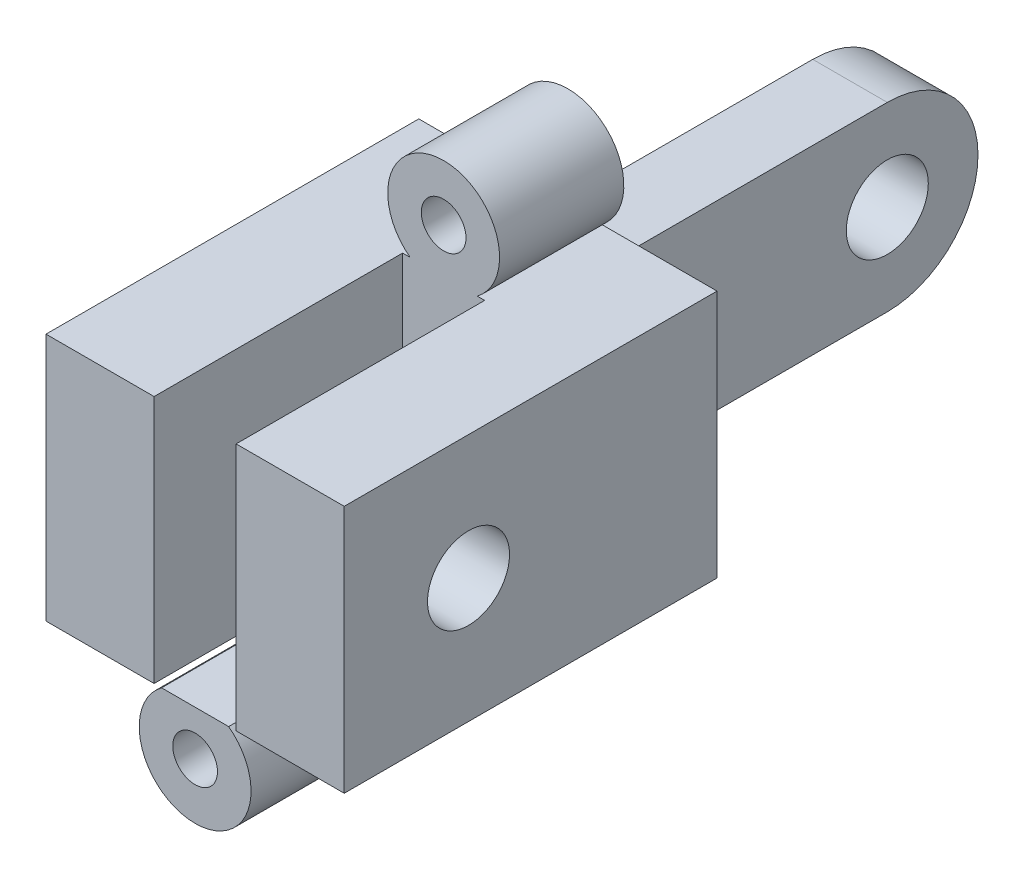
ISO-10303-21;
HEADER;
FILE_DESCRIPTION(('STEP AP214'),'2;1');
FILE_NAME('part.step','',(''),(''),'','','');
FILE_SCHEMA(('AUTOMOTIVE_DESIGN { 1 0 10303 214 1 1 1 1 }'));
ENDSEC;
DATA;
#1=APPLICATION_CONTEXT('core data for automotive mechanical design processes');
#2=APPLICATION_PROTOCOL_DEFINITION('international standard','automotive_design',2000,#1);
#3=PRODUCT_CONTEXT('',#1,'mechanical');
#4=PRODUCT('Part','Part','',(#3));
#5=PRODUCT_RELATED_PRODUCT_CATEGORY('part','',(#4));
#6=PRODUCT_DEFINITION_FORMATION('','',#4);
#7=PRODUCT_DEFINITION_CONTEXT('part definition',#1,'design');
#8=PRODUCT_DEFINITION('design','',#6,#7);
#9=PRODUCT_DEFINITION_SHAPE('','',#8);
#10=(LENGTH_UNIT() NAMED_UNIT(*) SI_UNIT(.MILLI.,.METRE.));
#11=(NAMED_UNIT(*) PLANE_ANGLE_UNIT() SI_UNIT($,.RADIAN.));
#12=(NAMED_UNIT(*) SI_UNIT($,.STERADIAN.) SOLID_ANGLE_UNIT());
#13=UNCERTAINTY_MEASURE_WITH_UNIT(LENGTH_MEASURE(1.E-05),#10,'distance_accuracy_value','');
#14=(GEOMETRIC_REPRESENTATION_CONTEXT(3) GLOBAL_UNCERTAINTY_ASSIGNED_CONTEXT((#13)) GLOBAL_UNIT_ASSIGNED_CONTEXT((#10,
#11,#12)) REPRESENTATION_CONTEXT('',''));
#15=CARTESIAN_POINT('',(0.,0.,0.));
#16=DIRECTION('',(0.,0.,1.));
#17=DIRECTION('',(1.,0.,0.));
#18=AXIS2_PLACEMENT_3D('',#15,#16,#17);
#19=CARTESIAN_POINT('',(0.,0.,0.));
#20=DIRECTION('',(0.,-1.,0.));
#21=DIRECTION('',(0.,0.,-1.));
#22=AXIS2_PLACEMENT_3D('',#19,#20,#21);
#23=PLANE('',#22);
#24=DIRECTION('',(0.,0.,-1.));
#25=VECTOR('',#24,1.);
#26=CARTESIAN_POINT('',(4.65,0.,0.));
#27=LINE('',#26,#25);
#28=CARTESIAN_POINT('',(4.65,0.,-10.));
#29=VERTEX_POINT('',#28);
#30=CARTESIAN_POINT('',(4.65,0.,-15.));
#31=VERTEX_POINT('',#30);
#32=EDGE_CURVE('E70',#29,#31,#27,.T.);
#33=ORIENTED_EDGE('',*,*,#32,.F.);
#34=DIRECTION('',(1.,0.,0.));
#35=VECTOR('',#34,1.);
#36=CARTESIAN_POINT('',(4.35,0.,-10.));
#37=LINE('',#36,#35);
#38=CARTESIAN_POINT('',(4.35,0.,-10.));
#39=VERTEX_POINT('',#38);
#40=EDGE_CURVE('E324',#39,#29,#37,.T.);
#41=ORIENTED_EDGE('',*,*,#40,.F.);
#42=DIRECTION('',(0.,0.,-1.));
#43=VECTOR('',#42,1.);
#44=CARTESIAN_POINT('',(4.35,0.,0.));
#45=LINE('',#44,#43);
#46=CARTESIAN_POINT('',(4.35,0.,0.));
#47=VERTEX_POINT('',#46);
#48=EDGE_CURVE('E321',#47,#39,#45,.T.);
#49=ORIENTED_EDGE('',*,*,#48,.F.);
#50=DIRECTION('',(1.,0.,0.));
#51=VECTOR('',#50,1.);
#52=CARTESIAN_POINT('',(0.,0.,0.));
#53=LINE('',#52,#51);
#54=CARTESIAN_POINT('',(0.,0.,0.));
#55=VERTEX_POINT('',#54);
#56=EDGE_CURVE('E318',#55,#47,#53,.T.);
#57=ORIENTED_EDGE('',*,*,#56,.F.);
#58=DIRECTION('',(0.,0.,1.));
#59=VECTOR('',#58,1.);
#60=CARTESIAN_POINT('',(0.,0.,0.));
#61=LINE('',#60,#59);
#62=CARTESIAN_POINT('',(0.,0.,-15.));
#63=VERTEX_POINT('',#62);
#64=EDGE_CURVE('E315',#63,#55,#61,.T.);
#65=ORIENTED_EDGE('',*,*,#64,.F.);
#66=DIRECTION('',(1.,0.,0.));
#67=VECTOR('',#66,1.);
#68=CARTESIAN_POINT('',(7.5,0.,-15.));
#69=LINE('',#68,#67);
#70=EDGE_CURVE('E232',#63,#31,#69,.T.);
#71=ORIENTED_EDGE('',*,*,#70,.T.);
#72=EDGE_LOOP('',(#33,#41,#49,#57,#65,#71));
#73=FACE_BOUND('',#72,.T.);
#74=ADVANCED_FACE('F45',(#73),#23,.T.);
#75=CARTESIAN_POINT('',(0.,10.,0.));
#76=DIRECTION('',(0.,-1.,0.));
#77=DIRECTION('',(0.,0.,-1.));
#78=AXIS2_PLACEMENT_3D('',#75,#76,#77);
#79=PLANE('',#78);
#80=DIRECTION('',(1.,0.,0.));
#81=VECTOR('',#80,1.);
#82=CARTESIAN_POINT('',(4.35,10.,-10.));
#83=LINE('',#82,#81);
#84=CARTESIAN_POINT('',(4.35,10.,-10.));
#85=VERTEX_POINT('',#84);
#86=CARTESIAN_POINT('',(4.65,10.,-10.));
#87=VERTEX_POINT('',#86);
#88=EDGE_CURVE('E300',#85,#87,#83,.T.);
#89=ORIENTED_EDGE('',*,*,#88,.T.);
#90=DIRECTION('',(0.,0.,-1.));
#91=VECTOR('',#90,1.);
#92=CARTESIAN_POINT('',(4.65,10.,-10.));
#93=LINE('',#92,#91);
#94=CARTESIAN_POINT('',(4.65,10.,-15.));
#95=VERTEX_POINT('',#94);
#96=EDGE_CURVE('E216',#87,#95,#93,.T.);
#97=ORIENTED_EDGE('',*,*,#96,.T.);
#98=DIRECTION('',(1.,0.,0.));
#99=VECTOR('',#98,1.);
#100=CARTESIAN_POINT('',(7.5,10.,-15.));
#101=LINE('',#100,#99);
#102=CARTESIAN_POINT('',(0.,10.,-15.));
#103=VERTEX_POINT('',#102);
#104=EDGE_CURVE('E237',#103,#95,#101,.T.);
#105=ORIENTED_EDGE('',*,*,#104,.F.);
#106=DIRECTION('',(0.,0.,1.));
#107=VECTOR('',#106,1.);
#108=CARTESIAN_POINT('',(0.,10.,0.));
#109=LINE('',#108,#107);
#110=CARTESIAN_POINT('',(0.,10.,0.));
#111=VERTEX_POINT('',#110);
#112=EDGE_CURVE('E289',#103,#111,#109,.T.);
#113=ORIENTED_EDGE('',*,*,#112,.T.);
#114=DIRECTION('',(1.,0.,0.));
#115=VECTOR('',#114,1.);
#116=CARTESIAN_POINT('',(0.,10.,0.));
#117=LINE('',#116,#115);
#118=CARTESIAN_POINT('',(4.35,10.,0.));
#119=VERTEX_POINT('',#118);
#120=EDGE_CURVE('E292',#111,#119,#117,.T.);
#121=ORIENTED_EDGE('',*,*,#120,.T.);
#122=DIRECTION('',(0.,0.,-1.));
#123=VECTOR('',#122,1.);
#124=CARTESIAN_POINT('',(4.35,10.,0.));
#125=LINE('',#124,#123);
#126=EDGE_CURVE('E296',#119,#85,#125,.T.);
#127=ORIENTED_EDGE('',*,*,#126,.T.);
#128=EDGE_LOOP('',(#89,#97,#105,#113,#121,#127));
#129=FACE_BOUND('',#128,.T.);
#130=ADVANCED_FACE('F413',(#129),#79,.F.);
#131=CARTESIAN_POINT('',(7.5,10.,-30.));
#132=DIRECTION('',(-1.,0.,0.));
#133=DIRECTION('',(0.,0.,1.));
#134=AXIS2_PLACEMENT_3D('',#131,#132,#133);
#135=PLANE('',#134);
#136=CARTESIAN_POINT('',(7.5,5.,-26.35));
#137=DIRECTION('',(1.,0.,0.));
#138=DIRECTION('',(0.,0.,-1.));
#139=AXIS2_PLACEMENT_3D('',#136,#137,#138);
#140=CIRCLE('',#139,1.65);
#141=CARTESIAN_POINT('',(7.5,5.,-28.));
#142=VERTEX_POINT('',#141);
#143=EDGE_CURVE('E284',#142,#142,#140,.T.);
#144=ORIENTED_EDGE('',*,*,#143,.F.);
#145=EDGE_LOOP('',(#144));
#146=FACE_BOUND('',#145,.T.);
#147=DIRECTION('',(0.,1.,0.));
#148=VECTOR('',#147,1.);
#149=CARTESIAN_POINT('',(7.5,0.,-15.));
#150=LINE('',#149,#148);
#151=CARTESIAN_POINT('',(7.5,1.35,-15.));
#152=VERTEX_POINT('',#151);
#153=CARTESIAN_POINT('',(7.5,8.65,-15.));
#154=VERTEX_POINT('',#153);
#155=EDGE_CURVE('E235',#152,#154,#150,.T.);
#156=ORIENTED_EDGE('',*,*,#155,.F.);
#157=DIRECTION('',(0.,0.,1.));
#158=VECTOR('',#157,1.);
#159=CARTESIAN_POINT('',(7.5,1.35,-20.));
#160=LINE('',#159,#158);
#161=CARTESIAN_POINT('',(7.5,1.35,-26.35));
#162=VERTEX_POINT('',#161);
#163=EDGE_CURVE('E275',#162,#152,#160,.T.);
#164=ORIENTED_EDGE('',*,*,#163,.F.);
#165=CARTESIAN_POINT('',(7.5,5.,-26.35));
#166=DIRECTION('',(-1.,0.,0.));
#167=DIRECTION('',(0.,0.,1.));
#168=AXIS2_PLACEMENT_3D('',#165,#166,#167);
#169=CIRCLE('',#168,3.65);
#170=CARTESIAN_POINT('',(7.5,5.,-30.));
#171=VERTEX_POINT('',#170);
#172=EDGE_CURVE('E369',#162,#171,#169,.F.);
#173=ORIENTED_EDGE('',*,*,#172,.T.);
#174=CARTESIAN_POINT('',(7.5,5.,-26.35));
#175=DIRECTION('',(-1.,0.,0.));
#176=DIRECTION('',(0.,0.,1.));
#177=AXIS2_PLACEMENT_3D('',#174,#175,#176);
#178=CIRCLE('',#177,3.65);
#179=CARTESIAN_POINT('',(7.5,8.65,-26.35));
#180=VERTEX_POINT('',#179);
#181=EDGE_CURVE('E366',#171,#180,#178,.F.);
#182=ORIENTED_EDGE('',*,*,#181,.T.);
#183=DIRECTION('',(0.,0.,-1.));
#184=VECTOR('',#183,1.);
#185=CARTESIAN_POINT('',(7.5,8.65,-20.));
#186=LINE('',#185,#184);
#187=EDGE_CURVE('E270',#154,#180,#186,.T.);
#188=ORIENTED_EDGE('',*,*,#187,.F.);
#189=EDGE_LOOP('',(#156,#164,#173,#182,#188));
#190=FACE_BOUND('',#189,.T.);
#191=ADVANCED_FACE('F394',(#146,#190),#135,.F.);
#192=CARTESIAN_POINT('',(4.5,10.,-30.));
#193=DIRECTION('',(1.,0.,0.));
#194=DIRECTION('',(0.,0.,-1.));
#195=AXIS2_PLACEMENT_3D('',#192,#193,#194);
#196=PLANE('',#195);
#197=CARTESIAN_POINT('',(4.5,5.,-26.35));
#198=DIRECTION('',(1.,0.,0.));
#199=DIRECTION('',(0.,0.,-1.));
#200=AXIS2_PLACEMENT_3D('',#197,#198,#199);
#201=CIRCLE('',#200,1.65);
#202=CARTESIAN_POINT('',(4.5,5.,-28.));
#203=VERTEX_POINT('',#202);
#204=EDGE_CURVE('E288',#203,#203,#201,.T.);
#205=ORIENTED_EDGE('',*,*,#204,.T.);
#206=EDGE_LOOP('',(#205));
#207=FACE_BOUND('',#206,.T.);
#208=DIRECTION('',(0.,0.,1.));
#209=VECTOR('',#208,1.);
#210=CARTESIAN_POINT('',(4.5,1.35,-30.));
#211=LINE('',#210,#209);
#212=CARTESIAN_POINT('',(4.5,1.35,-26.35));
#213=VERTEX_POINT('',#212);
#214=CARTESIAN_POINT('',(4.5,1.35,-15.));
#215=VERTEX_POINT('',#214);
#216=EDGE_CURVE('E274',#213,#215,#211,.T.);
#217=ORIENTED_EDGE('',*,*,#216,.T.);
#218=DIRECTION('',(0.,1.,0.));
#219=VECTOR('',#218,1.);
#220=CARTESIAN_POINT('',(4.5,0.,-15.));
#221=LINE('',#220,#219);
#222=CARTESIAN_POINT('',(4.5,8.65,-15.));
#223=VERTEX_POINT('',#222);
#224=EDGE_CURVE('E231',#215,#223,#221,.T.);
#225=ORIENTED_EDGE('',*,*,#224,.T.);
#226=DIRECTION('',(0.,0.,-1.));
#227=VECTOR('',#226,1.);
#228=CARTESIAN_POINT('',(4.5,8.65,-30.));
#229=LINE('',#228,#227);
#230=CARTESIAN_POINT('',(4.5,8.65,-26.35));
#231=VERTEX_POINT('',#230);
#232=EDGE_CURVE('E280',#223,#231,#229,.T.);
#233=ORIENTED_EDGE('',*,*,#232,.T.);
#234=CARTESIAN_POINT('',(4.5,5.,-26.35));
#235=DIRECTION('',(1.,0.,0.));
#236=DIRECTION('',(0.,0.,-1.));
#237=AXIS2_PLACEMENT_3D('',#234,#235,#236);
#238=CIRCLE('',#237,3.65);
#239=CARTESIAN_POINT('',(4.5,5.,-30.));
#240=VERTEX_POINT('',#239);
#241=EDGE_CURVE('E372',#231,#240,#238,.F.);
#242=ORIENTED_EDGE('',*,*,#241,.T.);
#243=CARTESIAN_POINT('',(4.5,5.,-26.35));
#244=DIRECTION('',(1.,0.,0.));
#245=DIRECTION('',(0.,0.,-1.));
#246=AXIS2_PLACEMENT_3D('',#243,#244,#245);
#247=CIRCLE('',#246,3.65);
#248=EDGE_CURVE('E55',#240,#213,#247,.F.);
#249=ORIENTED_EDGE('',*,*,#248,.T.);
#250=EDGE_LOOP('',(#217,#225,#233,#242,#249));
#251=FACE_BOUND('',#250,.T.);
#252=ADVANCED_FACE('F379',(#207,#251),#196,.F.);
#253=CARTESIAN_POINT('',(0.,10.,0.));
#254=DIRECTION('',(1.,0.,0.));
#255=DIRECTION('',(0.,0.,-1.));
#256=AXIS2_PLACEMENT_3D('',#253,#254,#255);
#257=PLANE('',#256);
#258=CARTESIAN_POINT('',(0.,5.,-5.));
#259=DIRECTION('',(1.,0.,0.));
#260=DIRECTION('',(0.,0.,-1.));
#261=AXIS2_PLACEMENT_3D('',#258,#259,#260);
#262=CIRCLE('',#261,1.65);
#263=CARTESIAN_POINT('',(0.,5.,-6.65));
#264=VERTEX_POINT('',#263);
#265=EDGE_CURVE('E255',#264,#264,#262,.T.);
#266=ORIENTED_EDGE('',*,*,#265,.T.);
#267=EDGE_LOOP('',(#266));
#268=FACE_BOUND('',#267,.T.);
#269=ORIENTED_EDGE('',*,*,#112,.F.);
#270=DIRECTION('',(0.,1.,0.));
#271=VECTOR('',#270,1.);
#272=CARTESIAN_POINT('',(0.,0.,-15.));
#273=LINE('',#272,#271);
#274=EDGE_CURVE('E249',#63,#103,#273,.T.);
#275=ORIENTED_EDGE('',*,*,#274,.F.);
#276=ORIENTED_EDGE('',*,*,#64,.T.);
#277=DIRECTION('',(0.,-1.,0.));
#278=VECTOR('',#277,1.);
#279=CARTESIAN_POINT('',(0.,10.,0.));
#280=LINE('',#279,#278);
#281=EDGE_CURVE('E355',#111,#55,#280,.T.);
#282=ORIENTED_EDGE('',*,*,#281,.F.);
#283=EDGE_LOOP('',(#269,#275,#276,#282));
#284=FACE_BOUND('',#283,.T.);
#285=ADVANCED_FACE('F466',(#268,#284),#257,.F.);
#286=CARTESIAN_POINT('',(0.,10.,0.));
#287=DIRECTION('',(0.,0.,-1.));
#288=DIRECTION('',(-1.,0.,0.));
#289=AXIS2_PLACEMENT_3D('',#286,#287,#288);
#290=PLANE('',#289);
#291=ORIENTED_EDGE('',*,*,#56,.T.);
#292=DIRECTION('',(0.,-1.,0.));
#293=VECTOR('',#292,1.);
#294=CARTESIAN_POINT('',(4.35,10.,0.));
#295=LINE('',#294,#293);
#296=EDGE_CURVE('E351',#119,#47,#295,.T.);
#297=ORIENTED_EDGE('',*,*,#296,.F.);
#298=ORIENTED_EDGE('',*,*,#120,.F.);
#299=ORIENTED_EDGE('',*,*,#281,.T.);
#300=EDGE_LOOP('',(#291,#297,#298,#299));
#301=FACE_BOUND('',#300,.T.);
#302=ADVANCED_FACE('F482',(#301),#290,.F.);
#303=CARTESIAN_POINT('',(4.35,10.,0.));
#304=DIRECTION('',(-1.,0.,0.));
#305=DIRECTION('',(0.,0.,1.));
#306=AXIS2_PLACEMENT_3D('',#303,#304,#305);
#307=PLANE('',#306);
#308=CARTESIAN_POINT('',(4.35,5.,-5.));
#309=DIRECTION('',(-1.,0.,0.));
#310=DIRECTION('',(0.,0.,1.));
#311=AXIS2_PLACEMENT_3D('',#308,#309,#310);
#312=CIRCLE('',#311,1.65);
#313=CARTESIAN_POINT('',(4.35,5.,-6.65));
#314=VERTEX_POINT('',#313);
#315=EDGE_CURVE('E266',#314,#314,#312,.T.);
#316=ORIENTED_EDGE('',*,*,#315,.T.);
#317=EDGE_LOOP('',(#316));
#318=FACE_BOUND('',#317,.T.);
#319=ORIENTED_EDGE('',*,*,#48,.T.);
#320=DIRECTION('',(0.,-1.,0.));
#321=VECTOR('',#320,1.);
#322=CARTESIAN_POINT('',(4.35,10.,-10.));
#323=LINE('',#322,#321);
#324=EDGE_CURVE('E347',#85,#39,#323,.T.);
#325=ORIENTED_EDGE('',*,*,#324,.F.);
#326=ORIENTED_EDGE('',*,*,#126,.F.);
#327=ORIENTED_EDGE('',*,*,#296,.T.);
#328=EDGE_LOOP('',(#319,#325,#326,#327));
#329=FACE_BOUND('',#328,.T.);
#330=ADVANCED_FACE('F478',(#318,#329),#307,.F.);
#331=CARTESIAN_POINT('',(4.35,10.,-10.));
#332=DIRECTION('',(0.,0.,-1.));
#333=DIRECTION('',(-1.,0.,0.));
#334=AXIS2_PLACEMENT_3D('',#331,#332,#333);
#335=PLANE('',#334);
#336=CARTESIAN_POINT('',(6.,11.8,-10.));
#337=DIRECTION('',(0.,0.,-1.));
#338=DIRECTION('',(-1.,0.,0.));
#339=AXIS2_PLACEMENT_3D('',#336,#337,#338);
#340=CIRCLE('',#339,0.899999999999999);
#341=CARTESIAN_POINT('',(5.1,11.8,-10.));
#342=VERTEX_POINT('',#341);
#343=EDGE_CURVE('E204',#342,#342,#340,.T.);
#344=ORIENTED_EDGE('',*,*,#343,.T.);
#345=EDGE_LOOP('',(#344));
#346=FACE_BOUND('',#345,.T.);
#347=ORIENTED_EDGE('',*,*,#40,.T.);
#348=DIRECTION('',(1.,0.,0.));
#349=VECTOR('',#348,1.);
#350=CARTESIAN_POINT('',(4.35,0.,-10.));
#351=LINE('',#350,#349);
#352=CARTESIAN_POINT('',(7.35,0.,-10.));
#353=VERTEX_POINT('',#352);
#354=EDGE_CURVE('E180',#29,#353,#351,.T.);
#355=ORIENTED_EDGE('',*,*,#354,.T.);
#356=CARTESIAN_POINT('',(7.65,0.,-10.));
#357=VERTEX_POINT('',#356);
#358=EDGE_CURVE('E62',#353,#357,#37,.T.);
#359=ORIENTED_EDGE('',*,*,#358,.T.);
#360=DIRECTION('',(0.,-1.,0.));
#361=VECTOR('',#360,1.);
#362=CARTESIAN_POINT('',(7.65,10.,-10.));
#363=LINE('',#362,#361);
#364=CARTESIAN_POINT('',(7.65,10.,-10.));
#365=VERTEX_POINT('',#364);
#366=EDGE_CURVE('E343',#365,#357,#363,.T.);
#367=ORIENTED_EDGE('',*,*,#366,.F.);
#368=CARTESIAN_POINT('',(7.35,10.,-10.));
#369=VERTEX_POINT('',#368);
#370=EDGE_CURVE('E299',#369,#365,#83,.T.);
#371=ORIENTED_EDGE('',*,*,#370,.F.);
#372=CARTESIAN_POINT('',(6.,11.8,-10.));
#373=DIRECTION('',(0.,0.,-1.));
#374=DIRECTION('',(-1.,0.,0.));
#375=AXIS2_PLACEMENT_3D('',#372,#373,#374);
#376=CIRCLE('',#375,2.25);
#377=EDGE_CURVE('E210',#87,#369,#376,.T.);
#378=ORIENTED_EDGE('',*,*,#377,.F.);
#379=ORIENTED_EDGE('',*,*,#88,.F.);
#380=ORIENTED_EDGE('',*,*,#324,.T.);
#381=EDGE_LOOP('',(#347,#355,#359,#367,#371,#378,#379,#380));
#382=FACE_BOUND('',#381,.T.);
#383=ADVANCED_FACE('F421',(#346,#382),#335,.F.);
#384=CARTESIAN_POINT('',(7.65,10.,0.));
#385=DIRECTION('',(1.,0.,0.));
#386=DIRECTION('',(0.,0.,-1.));
#387=AXIS2_PLACEMENT_3D('',#384,#385,#386);
#388=PLANE('',#387);
#389=CARTESIAN_POINT('',(7.65,5.,-5.));
#390=DIRECTION('',(1.,0.,0.));
#391=DIRECTION('',(0.,0.,-1.));
#392=AXIS2_PLACEMENT_3D('',#389,#390,#391);
#393=CIRCLE('',#392,1.65);
#394=CARTESIAN_POINT('',(7.65,5.,-6.65));
#395=VERTEX_POINT('',#394);
#396=EDGE_CURVE('E259',#395,#395,#393,.T.);
#397=ORIENTED_EDGE('',*,*,#396,.T.);
#398=EDGE_LOOP('',(#397));
#399=FACE_BOUND('',#398,.T.);
#400=DIRECTION('',(0.,0.,1.));
#401=VECTOR('',#400,1.);
#402=CARTESIAN_POINT('',(7.65,0.,0.));
#403=LINE('',#402,#401);
#404=CARTESIAN_POINT('',(7.65,0.,0.));
#405=VERTEX_POINT('',#404);
#406=EDGE_CURVE('E327',#357,#405,#403,.T.);
#407=ORIENTED_EDGE('',*,*,#406,.T.);
#408=DIRECTION('',(0.,-1.,0.));
#409=VECTOR('',#408,1.);
#410=CARTESIAN_POINT('',(7.65,10.,0.));
#411=LINE('',#410,#409);
#412=CARTESIAN_POINT('',(7.65,10.,0.));
#413=VERTEX_POINT('',#412);
#414=EDGE_CURVE('E339',#413,#405,#411,.T.);
#415=ORIENTED_EDGE('',*,*,#414,.F.);
#416=DIRECTION('',(0.,0.,1.));
#417=VECTOR('',#416,1.);
#418=CARTESIAN_POINT('',(7.65,10.,0.));
#419=LINE('',#418,#417);
#420=EDGE_CURVE('E304',#365,#413,#419,.T.);
#421=ORIENTED_EDGE('',*,*,#420,.F.);
#422=ORIENTED_EDGE('',*,*,#366,.T.);
#423=EDGE_LOOP('',(#407,#415,#421,#422));
#424=FACE_BOUND('',#423,.T.);
#425=ADVANCED_FACE('F445',(#399,#424),#388,.F.);
#426=CARTESIAN_POINT('',(7.65,10.,0.));
#427=DIRECTION('',(0.,0.,-1.));
#428=DIRECTION('',(-1.,0.,0.));
#429=AXIS2_PLACEMENT_3D('',#426,#427,#428);
#430=PLANE('',#429);
#431=DIRECTION('',(1.,0.,0.));
#432=VECTOR('',#431,1.);
#433=CARTESIAN_POINT('',(7.65,0.,0.));
#434=LINE('',#433,#432);
#435=CARTESIAN_POINT('',(12.,0.,0.));
#436=VERTEX_POINT('',#435);
#437=EDGE_CURVE('E330',#405,#436,#434,.T.);
#438=ORIENTED_EDGE('',*,*,#437,.T.);
#439=DIRECTION('',(0.,-1.,0.));
#440=VECTOR('',#439,1.);
#441=CARTESIAN_POINT('',(12.,10.,0.));
#442=LINE('',#441,#440);
#443=CARTESIAN_POINT('',(12.,10.,0.));
#444=VERTEX_POINT('',#443);
#445=EDGE_CURVE('E314',#444,#436,#442,.T.);
#446=ORIENTED_EDGE('',*,*,#445,.F.);
#447=DIRECTION('',(1.,0.,0.));
#448=VECTOR('',#447,1.);
#449=CARTESIAN_POINT('',(7.65,10.,0.));
#450=LINE('',#449,#448);
#451=EDGE_CURVE('E307',#413,#444,#450,.T.);
#452=ORIENTED_EDGE('',*,*,#451,.F.);
#453=ORIENTED_EDGE('',*,*,#414,.T.);
#454=EDGE_LOOP('',(#438,#446,#452,#453));
#455=FACE_BOUND('',#454,.T.);
#456=ADVANCED_FACE('F441',(#455),#430,.F.);
#457=CARTESIAN_POINT('',(12.,10.,0.));
#458=DIRECTION('',(-1.,0.,0.));
#459=DIRECTION('',(0.,0.,1.));
#460=AXIS2_PLACEMENT_3D('',#457,#458,#459);
#461=PLANE('',#460);
#462=CARTESIAN_POINT('',(12.,5.,-5.));
#463=DIRECTION('',(1.,0.,0.));
#464=DIRECTION('',(0.,0.,-1.));
#465=AXIS2_PLACEMENT_3D('',#462,#463,#464);
#466=CIRCLE('',#465,1.65);
#467=CARTESIAN_POINT('',(12.,5.,-6.65));
#468=VERTEX_POINT('',#467);
#469=EDGE_CURVE('E246',#468,#468,#466,.T.);
#470=ORIENTED_EDGE('',*,*,#469,.F.);
#471=EDGE_LOOP('',(#470));
#472=FACE_BOUND('',#471,.T.);
#473=DIRECTION('',(0.,0.,-1.));
#474=VECTOR('',#473,1.);
#475=CARTESIAN_POINT('',(12.,0.,0.));
#476=LINE('',#475,#474);
#477=CARTESIAN_POINT('',(12.,0.,-15.));
#478=VERTEX_POINT('',#477);
#479=EDGE_CURVE('E293',#436,#478,#476,.T.);
#480=ORIENTED_EDGE('',*,*,#479,.T.);
#481=DIRECTION('',(0.,1.,0.));
#482=VECTOR('',#481,1.);
#483=CARTESIAN_POINT('',(12.,0.,-15.));
#484=LINE('',#483,#482);
#485=CARTESIAN_POINT('',(12.,10.,-15.));
#486=VERTEX_POINT('',#485);
#487=EDGE_CURVE('E242',#478,#486,#484,.T.);
#488=ORIENTED_EDGE('',*,*,#487,.T.);
#489=DIRECTION('',(0.,0.,-1.));
#490=VECTOR('',#489,1.);
#491=CARTESIAN_POINT('',(12.,10.,0.));
#492=LINE('',#491,#490);
#493=EDGE_CURVE('E310',#444,#486,#492,.T.);
#494=ORIENTED_EDGE('',*,*,#493,.F.);
#495=ORIENTED_EDGE('',*,*,#445,.T.);
#496=EDGE_LOOP('',(#480,#488,#494,#495));
#497=FACE_BOUND('',#496,.T.);
#498=ADVANCED_FACE('F437',(#472,#497),#461,.F.);
#499=CARTESIAN_POINT('',(7.35,10.,-15.));
#500=VERTEX_POINT('',#499);
#501=EDGE_CURVE('E241',#500,#486,#101,.T.);
#502=ORIENTED_EDGE('',*,*,#501,.F.);
#503=DIRECTION('',(0.,0.,-1.));
#504=VECTOR('',#503,1.);
#505=CARTESIAN_POINT('',(7.35,10.,-10.));
#506=LINE('',#505,#504);
#507=EDGE_CURVE('E213',#369,#500,#506,.T.);
#508=ORIENTED_EDGE('',*,*,#507,.F.);
#509=ORIENTED_EDGE('',*,*,#370,.T.);
#510=ORIENTED_EDGE('',*,*,#420,.T.);
#511=ORIENTED_EDGE('',*,*,#451,.T.);
#512=ORIENTED_EDGE('',*,*,#493,.T.);
#513=EDGE_LOOP('',(#502,#508,#509,#510,#511,#512));
#514=FACE_BOUND('',#513,.T.);
#515=ADVANCED_FACE('F446',(#514),#79,.F.);
#516=DIRECTION('',(0.,0.,-1.));
#517=VECTOR('',#516,1.);
#518=CARTESIAN_POINT('',(7.35,0.,0.));
#519=LINE('',#518,#517);
#520=CARTESIAN_POINT('',(7.35,0.,-15.));
#521=VERTEX_POINT('',#520);
#522=EDGE_CURVE('E183',#353,#521,#519,.T.);
#523=ORIENTED_EDGE('',*,*,#522,.T.);
#524=EDGE_CURVE('E236',#521,#478,#69,.T.);
#525=ORIENTED_EDGE('',*,*,#524,.T.);
#526=ORIENTED_EDGE('',*,*,#479,.F.);
#527=ORIENTED_EDGE('',*,*,#437,.F.);
#528=ORIENTED_EDGE('',*,*,#406,.F.);
#529=ORIENTED_EDGE('',*,*,#358,.F.);
#530=EDGE_LOOP('',(#523,#525,#526,#527,#528,#529));
#531=FACE_BOUND('',#530,.T.);
#532=ADVANCED_FACE('F431',(#531),#23,.T.);
#533=CARTESIAN_POINT('',(-2.5,5.,-26.35));
#534=DIRECTION('',(1.,0.,0.));
#535=DIRECTION('',(0.,0.,-1.));
#536=AXIS2_PLACEMENT_3D('',#533,#534,#535);
#537=CYLINDRICAL_SURFACE('',#536,1.65);
#538=ORIENTED_EDGE('',*,*,#143,.T.);
#539=EDGE_LOOP('',(#538));
#540=FACE_BOUND('',#539,.T.);
#541=ORIENTED_EDGE('',*,*,#204,.F.);
#542=EDGE_LOOP('',(#541));
#543=FACE_BOUND('',#542,.T.);
#544=ADVANCED_FACE('F454',(#540,#543),#537,.F.);
#545=CARTESIAN_POINT('',(-2.5,1.35,-20.));
#546=DIRECTION('',(0.,1.,0.));
#547=DIRECTION('',(0.,0.,1.));
#548=AXIS2_PLACEMENT_3D('',#545,#546,#547);
#549=PLANE('',#548);
#550=ORIENTED_EDGE('',*,*,#216,.F.);
#551=DIRECTION('',(1.,0.,0.));
#552=VECTOR('',#551,1.);
#553=CARTESIAN_POINT('',(-2.5,1.35,-26.35));
#554=LINE('',#553,#552);
#555=EDGE_CURVE('E359',#213,#162,#554,.T.);
#556=ORIENTED_EDGE('',*,*,#555,.T.);
#557=ORIENTED_EDGE('',*,*,#163,.T.);
#558=DIRECTION('',(-1.,0.,0.));
#559=VECTOR('',#558,1.);
#560=CARTESIAN_POINT('',(4.5,1.35,-15.));
#561=LINE('',#560,#559);
#562=EDGE_CURVE('E220',#152,#215,#561,.T.);
#563=ORIENTED_EDGE('',*,*,#562,.T.);
#564=EDGE_LOOP('',(#550,#556,#557,#563));
#565=FACE_BOUND('',#564,.T.);
#566=ADVANCED_FACE('F386',(#565),#549,.F.);
#567=CARTESIAN_POINT('',(-2.5,8.65,-20.));
#568=DIRECTION('',(0.,-1.,0.));
#569=DIRECTION('',(0.,0.,-1.));
#570=AXIS2_PLACEMENT_3D('',#567,#568,#569);
#571=PLANE('',#570);
#572=ORIENTED_EDGE('',*,*,#187,.T.);
#573=DIRECTION('',(1.,0.,0.));
#574=VECTOR('',#573,1.);
#575=CARTESIAN_POINT('',(-2.5,8.65,-26.35));
#576=LINE('',#575,#574);
#577=EDGE_CURVE('E11',#180,#231,#576,.F.);
#578=ORIENTED_EDGE('',*,*,#577,.T.);
#579=ORIENTED_EDGE('',*,*,#232,.F.);
#580=DIRECTION('',(1.,0.,0.));
#581=VECTOR('',#580,1.);
#582=CARTESIAN_POINT('',(4.5,8.65,-15.));
#583=LINE('',#582,#581);
#584=EDGE_CURVE('E227',#223,#154,#583,.T.);
#585=ORIENTED_EDGE('',*,*,#584,.T.);
#586=EDGE_LOOP('',(#572,#578,#579,#585));
#587=FACE_BOUND('',#586,.T.);
#588=ADVANCED_FACE('F400',(#587),#571,.F.);
#589=CARTESIAN_POINT('',(4.5,5.,-26.35));
#590=DIRECTION('',(1.,0.,0.));
#591=DIRECTION('',(0.,0.,-1.));
#592=AXIS2_PLACEMENT_3D('',#589,#590,#591);
#593=CYLINDRICAL_SURFACE('',#592,3.65);
#594=DIRECTION('',(1.,0.,0.));
#595=VECTOR('',#594,1.);
#596=CARTESIAN_POINT('',(4.5,5.,-30.));
#597=LINE('',#596,#595);
#598=EDGE_CURVE('E49',#240,#171,#597,.T.);
#599=ORIENTED_EDGE('',*,*,#598,.F.);
#600=ORIENTED_EDGE('',*,*,#241,.F.);
#601=ORIENTED_EDGE('',*,*,#577,.F.);
#602=ORIENTED_EDGE('',*,*,#181,.F.);
#603=EDGE_LOOP('',(#599,#600,#601,#602));
#604=FACE_BOUND('',#603,.T.);
#605=ADVANCED_FACE('F47',(#604),#593,.T.);
#606=CARTESIAN_POINT('',(-2.5,5.,-26.35));
#607=DIRECTION('',(1.,0.,0.));
#608=DIRECTION('',(0.,1.,0.));
#609=AXIS2_PLACEMENT_3D('',#606,#607,#608);
#610=CYLINDRICAL_SURFACE('',#609,3.65);
#611=ORIENTED_EDGE('',*,*,#248,.F.);
#612=ORIENTED_EDGE('',*,*,#598,.T.);
#613=ORIENTED_EDGE('',*,*,#172,.F.);
#614=ORIENTED_EDGE('',*,*,#555,.F.);
#615=EDGE_LOOP('',(#611,#612,#613,#614));
#616=FACE_BOUND('',#615,.T.);
#617=ADVANCED_FACE('F390',(#616),#610,.T.);
#618=CARTESIAN_POINT('',(0.,5.,-5.));
#619=DIRECTION('',(1.,0.,0.));
#620=DIRECTION('',(0.,0.,-1.));
#621=AXIS2_PLACEMENT_3D('',#618,#619,#620);
#622=CYLINDRICAL_SURFACE('',#621,1.65);
#623=CARTESIAN_POINT('',(12.,5.,-6.65));
#624=CARTESIAN_POINT('',(11.9546875,5.,-6.65));
#625=CARTESIAN_POINT('',(11.909375,5.,-6.65));
#626=CARTESIAN_POINT('',(11.81875,5.,-6.65));
#627=CARTESIAN_POINT('',(11.7734375,5.,-6.65));
#628=CARTESIAN_POINT('',(11.6828125,5.,-6.65));
#629=CARTESIAN_POINT('',(11.6375,5.,-6.65));
#630=CARTESIAN_POINT('',(11.546875,5.,-6.65));
#631=CARTESIAN_POINT('',(11.5015625,5.,-6.65));
#632=CARTESIAN_POINT('',(11.4109375,5.,-6.65));
#633=CARTESIAN_POINT('',(11.365625,5.,-6.65));
#634=CARTESIAN_POINT('',(11.275,5.,-6.65));
#635=CARTESIAN_POINT('',(11.2296875,5.,-6.65));
#636=CARTESIAN_POINT('',(11.1390625,5.,-6.65));
#637=CARTESIAN_POINT('',(11.09375,5.,-6.65));
#638=CARTESIAN_POINT('',(11.003125,5.,-6.65));
#639=CARTESIAN_POINT('',(10.9578125,5.,-6.65));
#640=CARTESIAN_POINT('',(10.8671875,5.,-6.65));
#641=CARTESIAN_POINT('',(10.821875,5.,-6.65));
#642=CARTESIAN_POINT('',(10.73125,5.,-6.65));
#643=CARTESIAN_POINT('',(10.6859375,5.,-6.65));
#644=CARTESIAN_POINT('',(10.5953125,5.,-6.65));
#645=CARTESIAN_POINT('',(10.55,5.,-6.65));
#646=CARTESIAN_POINT('',(10.459375,5.,-6.65));
#647=CARTESIAN_POINT('',(10.4140625,5.,-6.65));
#648=CARTESIAN_POINT('',(10.3234375,5.,-6.65));
#649=CARTESIAN_POINT('',(10.278125,5.,-6.65));
#650=CARTESIAN_POINT('',(10.1875,5.,-6.65));
#651=CARTESIAN_POINT('',(10.1421875,5.,-6.65));
#652=CARTESIAN_POINT('',(10.0515625,5.,-6.65));
#653=CARTESIAN_POINT('',(10.00625,5.,-6.65));
#654=CARTESIAN_POINT('',(9.915625,5.,-6.65));
#655=CARTESIAN_POINT('',(9.8703125,5.,-6.65));
#656=CARTESIAN_POINT('',(9.7796875,5.,-6.65));
#657=CARTESIAN_POINT('',(9.734375,5.,-6.65));
#658=CARTESIAN_POINT('',(9.64375,5.,-6.65));
#659=CARTESIAN_POINT('',(9.5984375,5.,-6.65));
#660=CARTESIAN_POINT('',(9.5078125,5.,-6.65));
#661=CARTESIAN_POINT('',(9.4625,5.,-6.65));
#662=CARTESIAN_POINT('',(9.371875,5.,-6.65));
#663=CARTESIAN_POINT('',(9.3265625,5.,-6.65));
#664=CARTESIAN_POINT('',(9.2359375,5.,-6.65));
#665=CARTESIAN_POINT('',(9.190625,5.,-6.65));
#666=CARTESIAN_POINT('',(9.1,5.,-6.65));
#667=CARTESIAN_POINT('',(9.0546875,5.,-6.65));
#668=CARTESIAN_POINT('',(8.9640625,5.,-6.65));
#669=CARTESIAN_POINT('',(8.91875,5.,-6.65));
#670=CARTESIAN_POINT('',(8.828125,5.,-6.65));
#671=CARTESIAN_POINT('',(8.7828125,5.,-6.65));
#672=CARTESIAN_POINT('',(8.6921875,5.,-6.65));
#673=CARTESIAN_POINT('',(8.646875,5.,-6.65));
#674=CARTESIAN_POINT('',(8.55625,5.,-6.65));
#675=CARTESIAN_POINT('',(8.5109375,5.,-6.65));
#676=CARTESIAN_POINT('',(8.4203125,5.,-6.65));
#677=CARTESIAN_POINT('',(8.375,5.,-6.65));
#678=CARTESIAN_POINT('',(8.284375,5.,-6.65));
#679=CARTESIAN_POINT('',(8.2390625,5.,-6.65));
#680=CARTESIAN_POINT('',(8.1484375,5.,-6.65));
#681=CARTESIAN_POINT('',(8.103125,5.,-6.65));
#682=CARTESIAN_POINT('',(8.0125,5.,-6.65));
#683=CARTESIAN_POINT('',(7.9671875,5.,-6.65));
#684=CARTESIAN_POINT('',(7.8765625,5.,-6.65));
#685=CARTESIAN_POINT('',(7.83125,5.,-6.65));
#686=CARTESIAN_POINT('',(7.740625,5.,-6.65));
#687=CARTESIAN_POINT('',(7.6953125,5.,-6.65));
#688=CARTESIAN_POINT('',(7.65,5.,-6.65));
#689=B_SPLINE_CURVE_WITH_KNOTS('',3,(#623,#624,#625,#626,#627,#628,#629,#630,#631,#632,#633,
#634,#635,#636,#637,#638,#639,#640,#641,#642,#643,#644,#645,#646,#647,#648,#649,#650,#651,#652,
#653,#654,#655,#656,#657,#658,#659,#660,#661,#662,#663,#664,#665,#666,#667,#668,#669,#670,#671,
#672,#673,#674,#675,#676,#677,#678,#679,#680,#681,#682,#683,#684,#685,#686,#687,#688),
.UNSPECIFIED.,.F.,.F.,(4,2,2,2,2,2,2,2,2,2,2,2,2,2,2,2,2,2,2,2,2,2,2,2,2,2,2,2,2,2,2,2,4),(0.,
0.135937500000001,0.271875,0.4078125,0.543750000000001,0.6796875,0.815625,0.951562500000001,
1.0875,1.2234375,1.359375,1.4953125,1.63125,1.7671875,1.903125,2.0390625,2.175,2.3109375,
2.446875,2.5828125,2.71875,2.8546875,2.990625,3.1265625,3.2625,3.3984375,3.534375,3.6703125,
3.80625,3.9421875,4.078125,4.2140625,4.35),.UNSPECIFIED.);
#690=EDGE_CURVE('BSEAM490',#468,#395,#689,.T.);
#691=ORIENTED_EDGE('',*,*,#469,.T.);
#692=ORIENTED_EDGE('',*,*,#396,.F.);
#693=ORIENTED_EDGE('',*,*,#690,.T.);
#694=ORIENTED_EDGE('',*,*,#690,.F.);
#695=EDGE_LOOP('',(#691,#693,#692,#694));
#696=FACE_BOUND('',#695,.T.);
#697=ADVANCED_FACE('F490',(#696),#622,.F.);
#698=CARTESIAN_POINT('',(0.,5.,-6.65));
#699=CARTESIAN_POINT('',(0.0453124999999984,5.,-6.65));
#700=CARTESIAN_POINT('',(0.0906249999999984,5.,-6.65));
#701=CARTESIAN_POINT('',(0.181249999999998,5.,-6.65));
#702=CARTESIAN_POINT('',(0.226562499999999,5.,-6.65));
#703=CARTESIAN_POINT('',(0.317187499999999,5.,-6.65));
#704=CARTESIAN_POINT('',(0.362499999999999,5.,-6.65));
#705=CARTESIAN_POINT('',(0.453124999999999,5.,-6.65));
#706=CARTESIAN_POINT('',(0.498437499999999,5.,-6.65));
#707=CARTESIAN_POINT('',(0.589062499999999,5.,-6.65));
#708=CARTESIAN_POINT('',(0.634374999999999,5.,-6.65));
#709=CARTESIAN_POINT('',(0.724999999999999,5.,-6.65));
#710=CARTESIAN_POINT('',(0.770312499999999,5.,-6.65));
#711=CARTESIAN_POINT('',(0.860937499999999,5.,-6.65));
#712=CARTESIAN_POINT('',(0.906249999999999,5.,-6.65));
#713=CARTESIAN_POINT('',(0.996874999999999,5.,-6.65));
#714=CARTESIAN_POINT('',(1.0421875,5.,-6.65));
#715=CARTESIAN_POINT('',(1.1328125,5.,-6.65));
#716=CARTESIAN_POINT('',(1.178125,5.,-6.65));
#717=CARTESIAN_POINT('',(1.26875,5.,-6.65));
#718=CARTESIAN_POINT('',(1.3140625,5.,-6.65));
#719=CARTESIAN_POINT('',(1.4046875,5.,-6.65));
#720=CARTESIAN_POINT('',(1.45,5.,-6.65));
#721=CARTESIAN_POINT('',(1.540625,5.,-6.65));
#722=CARTESIAN_POINT('',(1.5859375,5.,-6.65));
#723=CARTESIAN_POINT('',(1.6765625,5.,-6.65));
#724=CARTESIAN_POINT('',(1.721875,5.,-6.65));
#725=CARTESIAN_POINT('',(1.8125,5.,-6.65));
#726=CARTESIAN_POINT('',(1.8578125,5.,-6.65));
#727=CARTESIAN_POINT('',(1.9484375,5.,-6.65));
#728=CARTESIAN_POINT('',(1.99375,5.,-6.65));
#729=CARTESIAN_POINT('',(2.084375,5.,-6.65));
#730=CARTESIAN_POINT('',(2.1296875,5.,-6.65));
#731=CARTESIAN_POINT('',(2.2203125,5.,-6.65));
#732=CARTESIAN_POINT('',(2.265625,5.,-6.65));
#733=CARTESIAN_POINT('',(2.35625,5.,-6.65));
#734=CARTESIAN_POINT('',(2.4015625,5.,-6.65));
#735=CARTESIAN_POINT('',(2.4921875,5.,-6.65));
#736=CARTESIAN_POINT('',(2.5375,5.,-6.65));
#737=CARTESIAN_POINT('',(2.628125,5.,-6.65));
#738=CARTESIAN_POINT('',(2.6734375,5.,-6.65));
#739=CARTESIAN_POINT('',(2.7640625,5.,-6.65));
#740=CARTESIAN_POINT('',(2.809375,5.,-6.65));
#741=CARTESIAN_POINT('',(2.9,5.,-6.65));
#742=CARTESIAN_POINT('',(2.9453125,5.,-6.65));
#743=CARTESIAN_POINT('',(3.0359375,5.,-6.65));
#744=CARTESIAN_POINT('',(3.08125,5.,-6.65));
#745=CARTESIAN_POINT('',(3.171875,5.,-6.65));
#746=CARTESIAN_POINT('',(3.2171875,5.,-6.65));
#747=CARTESIAN_POINT('',(3.3078125,5.,-6.65));
#748=CARTESIAN_POINT('',(3.353125,5.,-6.65));
#749=CARTESIAN_POINT('',(3.44375,5.,-6.65));
#750=CARTESIAN_POINT('',(3.4890625,5.,-6.65));
#751=CARTESIAN_POINT('',(3.5796875,5.,-6.65));
#752=CARTESIAN_POINT('',(3.625,5.,-6.65));
#753=CARTESIAN_POINT('',(3.715625,5.,-6.65));
#754=CARTESIAN_POINT('',(3.7609375,5.,-6.65));
#755=CARTESIAN_POINT('',(3.8515625,5.,-6.65));
#756=CARTESIAN_POINT('',(3.896875,5.,-6.65));
#757=CARTESIAN_POINT('',(3.9875,5.,-6.65));
#758=CARTESIAN_POINT('',(4.0328125,5.,-6.65));
#759=CARTESIAN_POINT('',(4.1234375,5.,-6.65));
#760=CARTESIAN_POINT('',(4.16875,5.,-6.65));
#761=CARTESIAN_POINT('',(4.259375,5.,-6.65));
#762=CARTESIAN_POINT('',(4.3046875,5.,-6.65));
#763=CARTESIAN_POINT('',(4.35,5.,-6.65));
#764=B_SPLINE_CURVE_WITH_KNOTS('',3,(#698,#699,#700,#701,#702,#703,#704,#705,#706,#707,#708,
#709,#710,#711,#712,#713,#714,#715,#716,#717,#718,#719,#720,#721,#722,#723,#724,#725,#726,#727,
#728,#729,#730,#731,#732,#733,#734,#735,#736,#737,#738,#739,#740,#741,#742,#743,#744,#745,#746,
#747,#748,#749,#750,#751,#752,#753,#754,#755,#756,#757,#758,#759,#760,#761,#762,#763),
.UNSPECIFIED.,.F.,.F.,(4,2,2,2,2,2,2,2,2,2,2,2,2,2,2,2,2,2,2,2,2,2,2,2,2,2,2,2,2,2,2,2,4),(0.,
0.1359375,0.271875,0.4078125,0.54375,0.6796875,0.815625,0.951562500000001,1.0875,1.2234375,
1.359375,1.4953125,1.63125,1.7671875,1.903125,2.0390625,2.175,2.3109375,2.446875,2.5828125,
2.71875,2.8546875,2.990625,3.1265625,3.2625,3.3984375,3.534375,3.6703125,3.80625,3.9421875,
4.078125,4.2140625,4.35),.UNSPECIFIED.);
#765=EDGE_CURVE('BSEAM407',#264,#314,#764,.T.);
#766=ORIENTED_EDGE('',*,*,#265,.F.);
#767=ORIENTED_EDGE('',*,*,#315,.F.);
#768=ORIENTED_EDGE('',*,*,#765,.T.);
#769=ORIENTED_EDGE('',*,*,#765,.F.);
#770=EDGE_LOOP('',(#766,#768,#767,#769));
#771=FACE_BOUND('',#770,.T.);
#772=ADVANCED_FACE('F407',(#771),#622,.F.);
#773=CARTESIAN_POINT('',(7.5,0.,-15.));
#774=DIRECTION('',(0.,0.,1.));
#775=DIRECTION('',(1.,0.,0.));
#776=AXIS2_PLACEMENT_3D('',#773,#774,#775);
#777=PLANE('',#776);
#778=CARTESIAN_POINT('',(6.,11.8,-15.));
#779=DIRECTION('',(0.,0.,-1.));
#780=DIRECTION('',(-1.,0.,0.));
#781=AXIS2_PLACEMENT_3D('',#778,#779,#780);
#782=CIRCLE('',#781,0.899999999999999);
#783=CARTESIAN_POINT('',(5.1,11.8,-15.));
#784=VERTEX_POINT('',#783);
#785=EDGE_CURVE('E711',#784,#784,#782,.T.);
#786=ORIENTED_EDGE('',*,*,#785,.F.);
#787=EDGE_LOOP('',(#786));
#788=FACE_BOUND('',#787,.T.);
#789=CARTESIAN_POINT('',(6.,-1.8,-15.));
#790=DIRECTION('',(0.,0.,-1.));
#791=DIRECTION('',(-1.,0.,0.));
#792=AXIS2_PLACEMENT_3D('',#789,#790,#791);
#793=CIRCLE('',#792,0.899999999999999);
#794=CARTESIAN_POINT('',(5.1,-1.8,-15.));
#795=VERTEX_POINT('',#794);
#796=EDGE_CURVE('E716',#795,#795,#793,.T.);
#797=ORIENTED_EDGE('',*,*,#796,.F.);
#798=EDGE_LOOP('',(#797));
#799=FACE_BOUND('',#798,.T.);
#800=ORIENTED_EDGE('',*,*,#224,.F.);
#801=ORIENTED_EDGE('',*,*,#562,.F.);
#802=ORIENTED_EDGE('',*,*,#155,.T.);
#803=ORIENTED_EDGE('',*,*,#584,.F.);
#804=EDGE_LOOP('',(#800,#801,#802,#803));
#805=FACE_BOUND('',#804,.T.);
#806=ORIENTED_EDGE('',*,*,#104,.T.);
#807=CARTESIAN_POINT('',(6.,11.8,-15.));
#808=DIRECTION('',(0.,0.,-1.));
#809=DIRECTION('',(-1.,0.,0.));
#810=AXIS2_PLACEMENT_3D('',#807,#808,#809);
#811=CIRCLE('',#810,2.25);
#812=EDGE_CURVE('E209',#95,#500,#811,.T.);
#813=ORIENTED_EDGE('',*,*,#812,.T.);
#814=ORIENTED_EDGE('',*,*,#501,.T.);
#815=ORIENTED_EDGE('',*,*,#487,.F.);
#816=ORIENTED_EDGE('',*,*,#524,.F.);
#817=CARTESIAN_POINT('',(6.,-1.8,-15.));
#818=DIRECTION('',(0.,0.,-1.));
#819=DIRECTION('',(-1.,0.,0.));
#820=AXIS2_PLACEMENT_3D('',#817,#818,#819);
#821=CIRCLE('',#820,2.25);
#822=EDGE_CURVE('E193',#521,#31,#821,.T.);
#823=ORIENTED_EDGE('',*,*,#822,.T.);
#824=ORIENTED_EDGE('',*,*,#70,.F.);
#825=ORIENTED_EDGE('',*,*,#274,.T.);
#826=EDGE_LOOP('',(#806,#813,#814,#815,#816,#823,#824,#825));
#827=FACE_BOUND('',#826,.T.);
#828=ADVANCED_FACE('F403',(#788,#799,#805,#827),#777,.F.);
#829=CARTESIAN_POINT('',(6.,11.8,-10.));
#830=DIRECTION('',(0.,0.,-1.));
#831=DIRECTION('',(-1.,0.,0.));
#832=AXIS2_PLACEMENT_3D('',#829,#830,#831);
#833=CYLINDRICAL_SURFACE('',#832,2.25);
#834=ORIENTED_EDGE('',*,*,#812,.F.);
#835=ORIENTED_EDGE('',*,*,#96,.F.);
#836=ORIENTED_EDGE('',*,*,#377,.T.);
#837=ORIENTED_EDGE('',*,*,#507,.T.);
#838=EDGE_LOOP('',(#834,#835,#836,#837));
#839=FACE_BOUND('',#838,.T.);
#840=ADVANCED_FACE('F406',(#839),#833,.T.);
#841=CARTESIAN_POINT('',(7.35,0.,0.));
#842=DIRECTION('',(0.,1.,0.));
#843=DIRECTION('',(0.,0.,1.));
#844=AXIS2_PLACEMENT_3D('',#841,#842,#843);
#845=PLANE('',#844);
#846=ORIENTED_EDGE('',*,*,#354,.F.);
#847=CARTESIAN_POINT('',(4.65,0.,0.));
#848=VERTEX_POINT('',#847);
#849=EDGE_CURVE('E174',#848,#29,#27,.T.);
#850=ORIENTED_EDGE('',*,*,#849,.F.);
#851=DIRECTION('',(1.,0.,0.));
#852=VECTOR('',#851,1.);
#853=CARTESIAN_POINT('',(7.35,0.,0.));
#854=LINE('',#853,#852);
#855=CARTESIAN_POINT('',(7.35,0.,0.));
#856=VERTEX_POINT('',#855);
#857=EDGE_CURVE('E179',#848,#856,#854,.T.);
#858=ORIENTED_EDGE('',*,*,#857,.T.);
#859=EDGE_CURVE('E190',#856,#353,#519,.T.);
#860=ORIENTED_EDGE('',*,*,#859,.T.);
#861=EDGE_LOOP('',(#846,#850,#858,#860));
#862=FACE_BOUND('',#861,.T.);
#863=ADVANCED_FACE('F176',(#862),#845,.T.);
#864=CARTESIAN_POINT('',(6.,-1.8,0.));
#865=DIRECTION('',(0.,0.,-1.));
#866=DIRECTION('',(-1.,0.,0.));
#867=AXIS2_PLACEMENT_3D('',#864,#865,#866);
#868=CYLINDRICAL_SURFACE('',#867,2.25);
#869=ORIENTED_EDGE('',*,*,#822,.F.);
#870=ORIENTED_EDGE('',*,*,#522,.F.);
#871=ORIENTED_EDGE('',*,*,#859,.F.);
#872=CARTESIAN_POINT('',(6.,-1.8,0.));
#873=DIRECTION('',(0.,0.,-1.));
#874=DIRECTION('',(-1.,0.,0.));
#875=AXIS2_PLACEMENT_3D('',#872,#873,#874);
#876=CIRCLE('',#875,2.25);
#877=EDGE_CURVE('E186',#856,#848,#876,.T.);
#878=ORIENTED_EDGE('',*,*,#877,.T.);
#879=ORIENTED_EDGE('',*,*,#849,.T.);
#880=ORIENTED_EDGE('',*,*,#32,.T.);
#881=EDGE_LOOP('',(#869,#870,#871,#878,#879,#880));
#882=FACE_BOUND('',#881,.T.);
#883=ADVANCED_FACE('F188',(#882),#868,.T.);
#884=CARTESIAN_POINT('',(6.,-1.8,0.));
#885=DIRECTION('',(0.,0.,-1.));
#886=DIRECTION('',(-1.,0.,0.));
#887=AXIS2_PLACEMENT_3D('',#884,#885,#886);
#888=PLANE('',#887);
#889=CARTESIAN_POINT('',(6.,-1.8,0.));
#890=DIRECTION('',(0.,0.,-1.));
#891=DIRECTION('',(-1.,0.,0.));
#892=AXIS2_PLACEMENT_3D('',#889,#890,#891);
#893=CIRCLE('',#892,0.899999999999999);
#894=CARTESIAN_POINT('',(5.1,-1.8,0.));
#895=VERTEX_POINT('',#894);
#896=EDGE_CURVE('E719',#895,#895,#893,.T.);
#897=ORIENTED_EDGE('',*,*,#896,.T.);
#898=EDGE_LOOP('',(#897));
#899=FACE_BOUND('',#898,.T.);
#900=ORIENTED_EDGE('',*,*,#877,.F.);
#901=ORIENTED_EDGE('',*,*,#857,.F.);
#902=EDGE_LOOP('',(#900,#901));
#903=FACE_BOUND('',#902,.T.);
#904=ADVANCED_FACE('F195',(#899,#903),#888,.F.);
#905=CARTESIAN_POINT('',(6.,-1.8,0.));
#906=DIRECTION('',(0.,0.,-1.));
#907=DIRECTION('',(-1.,0.,0.));
#908=AXIS2_PLACEMENT_3D('',#905,#906,#907);
#909=CYLINDRICAL_SURFACE('',#908,0.899999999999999);
#910=ORIENTED_EDGE('',*,*,#896,.F.);
#911=EDGE_LOOP('',(#910));
#912=FACE_BOUND('',#911,.T.);
#913=ORIENTED_EDGE('',*,*,#796,.T.);
#914=EDGE_LOOP('',(#913));
#915=FACE_BOUND('',#914,.T.);
#916=ADVANCED_FACE('F607',(#912,#915),#909,.F.);
#917=CARTESIAN_POINT('',(6.,11.8,0.));
#918=DIRECTION('',(0.,0.,-1.));
#919=DIRECTION('',(-1.,0.,0.));
#920=AXIS2_PLACEMENT_3D('',#917,#918,#919);
#921=CYLINDRICAL_SURFACE('',#920,0.899999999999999);
#922=ORIENTED_EDGE('',*,*,#785,.T.);
#923=EDGE_LOOP('',(#922));
#924=FACE_BOUND('',#923,.T.);
#925=ORIENTED_EDGE('',*,*,#343,.F.);
#926=EDGE_LOOP('',(#925));
#927=FACE_BOUND('',#926,.T.);
#928=ADVANCED_FACE('F616',(#924,#927),#921,.F.);
#929=CLOSED_SHELL('',(#74,#130,#191,#252,#285,#302,#330,#383,#425,#456,#498,#515,#532,#544,#566,
#588,#605,#617,#697,#772,#828,#840,#863,#883,#904,#916,#928));
#930=MANIFOLD_SOLID_BREP('B2',#929);
#931=ADVANCED_BREP_SHAPE_REPRESENTATION('',(#18,#930),#14);
#932=SHAPE_DEFINITION_REPRESENTATION(#9,#931);
ENDSEC;
END-ISO-10303-21;
